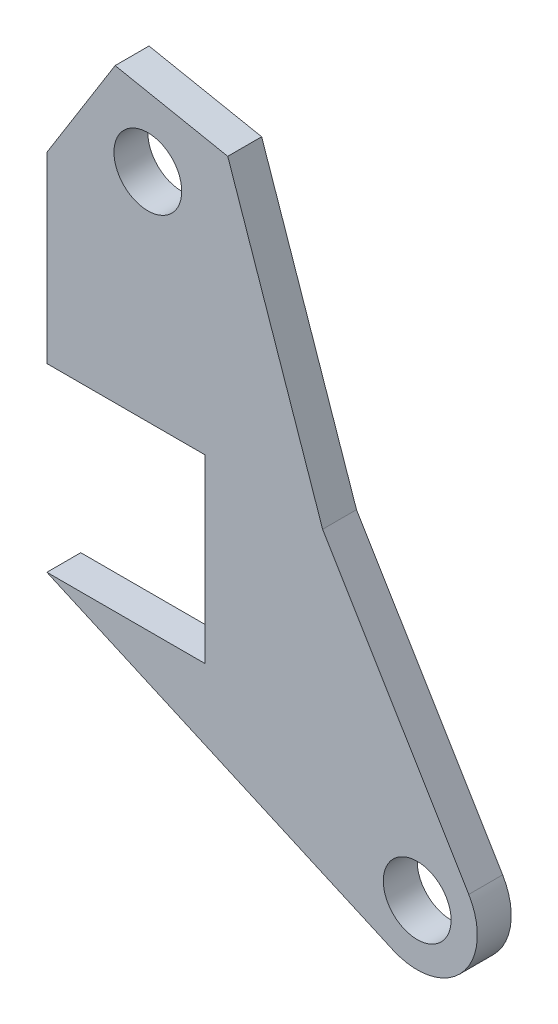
ISO-10303-21;
HEADER;
FILE_DESCRIPTION(('STEP AP214'),'2;1');
FILE_NAME('part.step','',(''),(''),'','','');
FILE_SCHEMA(('AUTOMOTIVE_DESIGN { 1 0 10303 214 1 1 1 1 }'));
ENDSEC;
DATA;
#1=APPLICATION_CONTEXT('core data for automotive mechanical design processes');
#2=APPLICATION_PROTOCOL_DEFINITION('international standard','automotive_design',2000,#1);
#3=PRODUCT_CONTEXT('',#1,'mechanical');
#4=PRODUCT('Part','Part','',(#3));
#5=PRODUCT_RELATED_PRODUCT_CATEGORY('part','',(#4));
#6=PRODUCT_DEFINITION_FORMATION('','',#4);
#7=PRODUCT_DEFINITION_CONTEXT('part definition',#1,'design');
#8=PRODUCT_DEFINITION('design','',#6,#7);
#9=PRODUCT_DEFINITION_SHAPE('','',#8);
#10=(LENGTH_UNIT() NAMED_UNIT(*) SI_UNIT(.MILLI.,.METRE.));
#11=(NAMED_UNIT(*) PLANE_ANGLE_UNIT() SI_UNIT($,.RADIAN.));
#12=(NAMED_UNIT(*) SI_UNIT($,.STERADIAN.) SOLID_ANGLE_UNIT());
#13=UNCERTAINTY_MEASURE_WITH_UNIT(LENGTH_MEASURE(1.E-05),#10,'distance_accuracy_value','');
#14=(GEOMETRIC_REPRESENTATION_CONTEXT(3) GLOBAL_UNCERTAINTY_ASSIGNED_CONTEXT((#13)) GLOBAL_UNIT_ASSIGNED_CONTEXT((#10,
#11,#12)) REPRESENTATION_CONTEXT('',''));
#15=CARTESIAN_POINT('',(0.,0.,0.));
#16=DIRECTION('',(0.,0.,1.));
#17=DIRECTION('',(1.,0.,0.));
#18=AXIS2_PLACEMENT_3D('',#15,#16,#17);
#19=CARTESIAN_POINT('',(163.914369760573,-123.84115803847,15.));
#20=DIRECTION('',(0.,0.,1.));
#21=DIRECTION('',(1.,0.,0.));
#22=AXIS2_PLACEMENT_3D('',#19,#20,#21);
#23=PLANE('',#22);
#24=CARTESIAN_POINT('',(44.6824565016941,95.8944805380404,15.));
#25=DIRECTION('',(0.,0.,1.));
#26=DIRECTION('',(1.,0.,0.));
#27=AXIS2_PLACEMENT_3D('',#24,#25,#26);
#28=CIRCLE('',#27,14.9999999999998);
#29=CARTESIAN_POINT('',(59.6824565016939,95.8944805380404,15.));
#30=VERTEX_POINT('',#29);
#31=EDGE_CURVE('E129',#30,#30,#28,.T.);
#32=ORIENTED_EDGE('',*,*,#31,.F.);
#33=EDGE_LOOP('',(#32));
#34=FACE_BOUND('',#33,.T.);
#35=DIRECTION('',(1.,0.,0.));
#36=VECTOR('',#35,1.);
#37=CARTESIAN_POINT('',(0.,0.,15.));
#38=LINE('',#37,#36);
#39=CARTESIAN_POINT('',(0.,0.,15.));
#40=VERTEX_POINT('',#39);
#41=CARTESIAN_POINT('',(69.9999999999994,0.,15.));
#42=VERTEX_POINT('',#41);
#43=EDGE_CURVE('E151',#40,#42,#38,.T.);
#44=ORIENTED_EDGE('',*,*,#43,.T.);
#45=DIRECTION('',(0.,-1.,0.));
#46=VECTOR('',#45,1.);
#47=CARTESIAN_POINT('',(69.9999999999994,0.,15.));
#48=LINE('',#47,#46);
#49=CARTESIAN_POINT('',(69.9999999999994,-80.0000000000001,15.));
#50=VERTEX_POINT('',#49);
#51=EDGE_CURVE('E124',#42,#50,#48,.T.);
#52=ORIENTED_EDGE('',*,*,#51,.T.);
#53=DIRECTION('',(-1.,0.,0.));
#54=VECTOR('',#53,1.);
#55=CARTESIAN_POINT('',(69.9999999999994,-80.0000000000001,15.));
#56=LINE('',#55,#54);
#57=CARTESIAN_POINT('',(0.,-80.0000000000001,15.));
#58=VERTEX_POINT('',#57);
#59=EDGE_CURVE('E154',#50,#58,#56,.T.);
#60=ORIENTED_EDGE('',*,*,#59,.T.);
#61=DIRECTION('',(0.913545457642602,-0.406736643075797,0.));
#62=VECTOR('',#61,1.);
#63=CARTESIAN_POINT('',(0.,-80.0000000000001,15.));
#64=LINE('',#63,#62);
#65=CARTESIAN_POINT('',(153.087410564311,-148.158906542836,15.));
#66=VERTEX_POINT('',#65);
#67=EDGE_CURVE('E156',#58,#66,#64,.T.);
#68=ORIENTED_EDGE('',*,*,#67,.T.);
#69=CARTESIAN_POINT('',(163.914369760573,-123.84115803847,15.));
#70=DIRECTION('',(0.,0.,1.));
#71=DIRECTION('',(1.,0.,0.));
#72=AXIS2_PLACEMENT_3D('',#69,#70,#71);
#73=CIRCLE('',#72,26.6190897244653);
#74=CARTESIAN_POINT('',(186.73138304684,-110.131313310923,15.));
#75=VERTEX_POINT('',#74);
#76=EDGE_CURVE('E158',#66,#75,#73,.T.);
#77=ORIENTED_EDGE('',*,*,#76,.T.);
#78=DIRECTION('',(-0.515038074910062,0.857167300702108,0.));
#79=VECTOR('',#78,1.);
#80=CARTESIAN_POINT('',(186.73138304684,-110.131313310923,15.));
#81=LINE('',#80,#79);
#82=CARTESIAN_POINT('',(122.055459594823,-2.49250090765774,15.));
#83=VERTEX_POINT('',#82);
#84=EDGE_CURVE('E160',#75,#83,#81,.T.);
#85=ORIENTED_EDGE('',*,*,#84,.T.);
#86=DIRECTION('',(-0.325568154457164,0.945518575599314,0.));
#87=VECTOR('',#86,1.);
#88=CARTESIAN_POINT('',(122.055459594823,-2.49250090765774,15.));
#89=LINE('',#88,#87);
#90=CARTESIAN_POINT('',(80.0571676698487,119.479395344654,15.));
#91=VERTEX_POINT('',#90);
#92=EDGE_CURVE('E162',#83,#91,#89,.T.);
#93=ORIENTED_EDGE('',*,*,#92,.T.);
#94=DIRECTION('',(-0.980998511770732,0.194015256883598,0.));
#95=VECTOR('',#94,1.);
#96=CARTESIAN_POINT('',(30.2053980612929,129.338741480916,15.));
#97=LINE('',#96,#95);
#98=CARTESIAN_POINT('',(30.2053980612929,129.338741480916,15.));
#99=VERTEX_POINT('',#98);
#100=EDGE_CURVE('E164',#91,#99,#97,.T.);
#101=ORIENTED_EDGE('',*,*,#100,.T.);
#102=DIRECTION('',(-0.529919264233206,-0.848048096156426,0.));
#103=VECTOR('',#102,1.);
#104=CARTESIAN_POINT('',(-8.88178419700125E-13,81.,15.));
#105=LINE('',#104,#103);
#106=CARTESIAN_POINT('',(-8.88178419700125E-13,81.,15.));
#107=VERTEX_POINT('',#106);
#108=EDGE_CURVE('E53',#99,#107,#105,.T.);
#109=ORIENTED_EDGE('',*,*,#108,.T.);
#110=DIRECTION('',(0.,-1.,0.));
#111=VECTOR('',#110,1.);
#112=CARTESIAN_POINT('',(0.,0.,15.));
#113=LINE('',#112,#111);
#114=EDGE_CURVE('E48',#107,#40,#113,.T.);
#115=ORIENTED_EDGE('',*,*,#114,.T.);
#116=EDGE_LOOP('',(#44,#52,#60,#68,#77,#85,#93,#101,#109,#115));
#117=FACE_BOUND('',#116,.T.);
#118=CARTESIAN_POINT('',(163.914369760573,-123.84115803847,15.));
#119=DIRECTION('',(0.,0.,1.));
#120=DIRECTION('',(1.,0.,0.));
#121=AXIS2_PLACEMENT_3D('',#118,#119,#120);
#122=CIRCLE('',#121,15.);
#123=CARTESIAN_POINT('',(178.914369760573,-123.84115803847,15.));
#124=VERTEX_POINT('',#123);
#125=EDGE_CURVE('E251',#124,#124,#122,.T.);
#126=ORIENTED_EDGE('',*,*,#125,.F.);
#127=EDGE_LOOP('',(#126));
#128=FACE_BOUND('',#127,.T.);
#129=ADVANCED_FACE('F33',(#34,#117,#128),#23,.T.);
#130=CARTESIAN_POINT('',(163.914369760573,-123.84115803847,0.));
#131=DIRECTION('',(0.,0.,1.));
#132=DIRECTION('',(1.,0.,0.));
#133=AXIS2_PLACEMENT_3D('',#130,#131,#132);
#134=PLANE('',#133);
#135=CARTESIAN_POINT('',(44.6824565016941,95.8944805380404,0.));
#136=DIRECTION('',(0.,0.,1.));
#137=DIRECTION('',(1.,0.,0.));
#138=AXIS2_PLACEMENT_3D('',#135,#136,#137);
#139=CIRCLE('',#138,14.9999999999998);
#140=CARTESIAN_POINT('',(59.6824565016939,95.8944805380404,0.));
#141=VERTEX_POINT('',#140);
#142=EDGE_CURVE('E132',#141,#141,#139,.T.);
#143=ORIENTED_EDGE('',*,*,#142,.T.);
#144=EDGE_LOOP('',(#143));
#145=FACE_BOUND('',#144,.T.);
#146=DIRECTION('',(1.,0.,0.));
#147=VECTOR('',#146,1.);
#148=CARTESIAN_POINT('',(0.,0.,0.));
#149=LINE('',#148,#147);
#150=CARTESIAN_POINT('',(0.,0.,0.));
#151=VERTEX_POINT('',#150);
#152=CARTESIAN_POINT('',(69.9999999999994,0.,0.));
#153=VERTEX_POINT('',#152);
#154=EDGE_CURVE('E115',#151,#153,#149,.T.);
#155=ORIENTED_EDGE('',*,*,#154,.F.);
#156=DIRECTION('',(0.,-1.,0.));
#157=VECTOR('',#156,1.);
#158=CARTESIAN_POINT('',(0.,0.,0.));
#159=LINE('',#158,#157);
#160=CARTESIAN_POINT('',(-8.88178419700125E-13,81.,0.));
#161=VERTEX_POINT('',#160);
#162=EDGE_CURVE('E149',#161,#151,#159,.T.);
#163=ORIENTED_EDGE('',*,*,#162,.F.);
#164=DIRECTION('',(-0.529919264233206,-0.848048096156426,0.));
#165=VECTOR('',#164,1.);
#166=CARTESIAN_POINT('',(-8.88178419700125E-13,81.,0.));
#167=LINE('',#166,#165);
#168=CARTESIAN_POINT('',(30.2053980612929,129.338741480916,0.));
#169=VERTEX_POINT('',#168);
#170=EDGE_CURVE('E147',#169,#161,#167,.T.);
#171=ORIENTED_EDGE('',*,*,#170,.F.);
#172=DIRECTION('',(-0.980998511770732,0.194015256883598,0.));
#173=VECTOR('',#172,1.);
#174=CARTESIAN_POINT('',(30.2053980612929,129.338741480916,0.));
#175=LINE('',#174,#173);
#176=CARTESIAN_POINT('',(80.0571676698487,119.479395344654,0.));
#177=VERTEX_POINT('',#176);
#178=EDGE_CURVE('E145',#177,#169,#175,.T.);
#179=ORIENTED_EDGE('',*,*,#178,.F.);
#180=DIRECTION('',(-0.325568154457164,0.945518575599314,0.));
#181=VECTOR('',#180,1.);
#182=CARTESIAN_POINT('',(122.055459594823,-2.49250090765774,0.));
#183=LINE('',#182,#181);
#184=CARTESIAN_POINT('',(122.055459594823,-2.49250090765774,0.));
#185=VERTEX_POINT('',#184);
#186=EDGE_CURVE('E143',#185,#177,#183,.T.);
#187=ORIENTED_EDGE('',*,*,#186,.F.);
#188=DIRECTION('',(-0.515038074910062,0.857167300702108,0.));
#189=VECTOR('',#188,1.);
#190=CARTESIAN_POINT('',(186.73138304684,-110.131313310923,0.));
#191=LINE('',#190,#189);
#192=CARTESIAN_POINT('',(186.73138304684,-110.131313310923,0.));
#193=VERTEX_POINT('',#192);
#194=EDGE_CURVE('E141',#193,#185,#191,.T.);
#195=ORIENTED_EDGE('',*,*,#194,.F.);
#196=CARTESIAN_POINT('',(163.914369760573,-123.84115803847,0.));
#197=DIRECTION('',(0.,0.,1.));
#198=DIRECTION('',(1.,0.,0.));
#199=AXIS2_PLACEMENT_3D('',#196,#197,#198);
#200=CIRCLE('',#199,26.6190897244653);
#201=CARTESIAN_POINT('',(153.087410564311,-148.158906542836,0.));
#202=VERTEX_POINT('',#201);
#203=EDGE_CURVE('E139',#202,#193,#200,.T.);
#204=ORIENTED_EDGE('',*,*,#203,.F.);
#205=DIRECTION('',(0.913545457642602,-0.406736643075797,0.));
#206=VECTOR('',#205,1.);
#207=CARTESIAN_POINT('',(0.,-80.0000000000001,0.));
#208=LINE('',#207,#206);
#209=CARTESIAN_POINT('',(0.,-80.0000000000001,0.));
#210=VERTEX_POINT('',#209);
#211=EDGE_CURVE('E137',#210,#202,#208,.T.);
#212=ORIENTED_EDGE('',*,*,#211,.F.);
#213=DIRECTION('',(-1.,0.,0.));
#214=VECTOR('',#213,1.);
#215=CARTESIAN_POINT('',(69.9999999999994,-80.0000000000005,0.));
#216=LINE('',#215,#214);
#217=CARTESIAN_POINT('',(69.9999999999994,-80.0000000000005,0.));
#218=VERTEX_POINT('',#217);
#219=EDGE_CURVE('E117',#218,#210,#216,.T.);
#220=ORIENTED_EDGE('',*,*,#219,.F.);
#221=DIRECTION('',(0.,-1.,0.));
#222=VECTOR('',#221,1.);
#223=CARTESIAN_POINT('',(69.9999999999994,0.,0.));
#224=LINE('',#223,#222);
#225=EDGE_CURVE('E110',#153,#218,#224,.T.);
#226=ORIENTED_EDGE('',*,*,#225,.F.);
#227=EDGE_LOOP('',(#155,#163,#171,#179,#187,#195,#204,#212,#220,#226));
#228=FACE_BOUND('',#227,.T.);
#229=CARTESIAN_POINT('',(163.914369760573,-123.84115803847,0.));
#230=DIRECTION('',(0.,0.,1.));
#231=DIRECTION('',(1.,0.,0.));
#232=AXIS2_PLACEMENT_3D('',#229,#230,#231);
#233=CIRCLE('',#232,15.);
#234=CARTESIAN_POINT('',(178.914369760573,-123.84115803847,0.));
#235=VERTEX_POINT('',#234);
#236=EDGE_CURVE('E254',#235,#235,#233,.T.);
#237=ORIENTED_EDGE('',*,*,#236,.T.);
#238=EDGE_LOOP('',(#237));
#239=FACE_BOUND('',#238,.T.);
#240=ADVANCED_FACE('F111',(#145,#228,#239),#134,.F.);
#241=CARTESIAN_POINT('',(0.,0.,15.));
#242=DIRECTION('',(0.,1.,0.));
#243=DIRECTION('',(0.,0.,1.));
#244=AXIS2_PLACEMENT_3D('',#241,#242,#243);
#245=PLANE('',#244);
#246=ORIENTED_EDGE('',*,*,#154,.T.);
#247=DIRECTION('',(0.,0.,-1.));
#248=VECTOR('',#247,1.);
#249=CARTESIAN_POINT('',(69.9999999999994,0.,15.));
#250=LINE('',#249,#248);
#251=EDGE_CURVE('E11',#42,#153,#250,.T.);
#252=ORIENTED_EDGE('',*,*,#251,.F.);
#253=ORIENTED_EDGE('',*,*,#43,.F.);
#254=DIRECTION('',(0.,0.,-1.));
#255=VECTOR('',#254,1.);
#256=CARTESIAN_POINT('',(0.,0.,15.));
#257=LINE('',#256,#255);
#258=EDGE_CURVE('E128',#40,#151,#257,.T.);
#259=ORIENTED_EDGE('',*,*,#258,.T.);
#260=EDGE_LOOP('',(#246,#252,#253,#259));
#261=FACE_BOUND('',#260,.T.);
#262=ADVANCED_FACE('F35',(#261),#245,.F.);
#263=CARTESIAN_POINT('',(69.9999999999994,0.,15.));
#264=DIRECTION('',(1.,0.,0.));
#265=DIRECTION('',(0.,1.,0.));
#266=AXIS2_PLACEMENT_3D('',#263,#264,#265);
#267=PLANE('',#266);
#268=ORIENTED_EDGE('',*,*,#225,.T.);
#269=DIRECTION('',(0.,0.,-1.));
#270=VECTOR('',#269,1.);
#271=CARTESIAN_POINT('',(69.9999999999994,-80.0000000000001,15.));
#272=LINE('',#271,#270);
#273=EDGE_CURVE('E41',#50,#218,#272,.T.);
#274=ORIENTED_EDGE('',*,*,#273,.F.);
#275=ORIENTED_EDGE('',*,*,#51,.F.);
#276=ORIENTED_EDGE('',*,*,#251,.T.);
#277=EDGE_LOOP('',(#268,#274,#275,#276));
#278=FACE_BOUND('',#277,.T.);
#279=ADVANCED_FACE('F123',(#278),#267,.F.);
#280=CARTESIAN_POINT('',(69.9999999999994,-80.0000000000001,15.));
#281=DIRECTION('',(0.,-1.,0.));
#282=DIRECTION('',(1.,0.,0.));
#283=AXIS2_PLACEMENT_3D('',#280,#281,#282);
#284=PLANE('',#283);
#285=ORIENTED_EDGE('',*,*,#219,.T.);
#286=DIRECTION('',(0.,0.,-1.));
#287=VECTOR('',#286,1.);
#288=CARTESIAN_POINT('',(0.,-80.0000000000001,15.));
#289=LINE('',#288,#287);
#290=EDGE_CURVE('E187',#58,#210,#289,.T.);
#291=ORIENTED_EDGE('',*,*,#290,.F.);
#292=ORIENTED_EDGE('',*,*,#59,.F.);
#293=ORIENTED_EDGE('',*,*,#273,.T.);
#294=EDGE_LOOP('',(#285,#291,#292,#293));
#295=FACE_BOUND('',#294,.T.);
#296=ADVANCED_FACE('F191',(#295),#284,.F.);
#297=CARTESIAN_POINT('',(0.,-80.0000000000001,15.));
#298=DIRECTION('',(0.406736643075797,0.913545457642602,0.));
#299=DIRECTION('',(-0.913545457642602,0.406736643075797,0.));
#300=AXIS2_PLACEMENT_3D('',#297,#298,#299);
#301=PLANE('',#300);
#302=ORIENTED_EDGE('',*,*,#211,.T.);
#303=DIRECTION('',(0.,0.,-1.));
#304=VECTOR('',#303,1.);
#305=CARTESIAN_POINT('',(153.087410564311,-148.158906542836,15.));
#306=LINE('',#305,#304);
#307=EDGE_CURVE('E184',#66,#202,#306,.T.);
#308=ORIENTED_EDGE('',*,*,#307,.F.);
#309=ORIENTED_EDGE('',*,*,#67,.F.);
#310=ORIENTED_EDGE('',*,*,#290,.T.);
#311=EDGE_LOOP('',(#302,#308,#309,#310));
#312=FACE_BOUND('',#311,.T.);
#313=ADVANCED_FACE('F199',(#312),#301,.F.);
#314=CARTESIAN_POINT('',(163.914369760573,-123.84115803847,15.));
#315=DIRECTION('',(0.,0.,-1.));
#316=DIRECTION('',(-1.,0.,0.));
#317=AXIS2_PLACEMENT_3D('',#314,#315,#316);
#318=CYLINDRICAL_SURFACE('',#317,26.6190897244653);
#319=ORIENTED_EDGE('',*,*,#203,.T.);
#320=DIRECTION('',(0.,0.,-1.));
#321=VECTOR('',#320,1.);
#322=CARTESIAN_POINT('',(186.73138304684,-110.131313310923,15.));
#323=LINE('',#322,#321);
#324=EDGE_CURVE('E181',#75,#193,#323,.T.);
#325=ORIENTED_EDGE('',*,*,#324,.F.);
#326=ORIENTED_EDGE('',*,*,#76,.F.);
#327=ORIENTED_EDGE('',*,*,#307,.T.);
#328=EDGE_LOOP('',(#319,#325,#326,#327));
#329=FACE_BOUND('',#328,.T.);
#330=ADVANCED_FACE('F202',(#329),#318,.T.);
#331=CARTESIAN_POINT('',(186.73138304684,-110.131313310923,15.));
#332=DIRECTION('',(-0.857167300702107,-0.515038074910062,0.));
#333=DIRECTION('',(0.515038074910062,-0.857167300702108,0.));
#334=AXIS2_PLACEMENT_3D('',#331,#332,#333);
#335=PLANE('',#334);
#336=ORIENTED_EDGE('',*,*,#194,.T.);
#337=DIRECTION('',(0.,0.,-1.));
#338=VECTOR('',#337,1.);
#339=CARTESIAN_POINT('',(122.055459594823,-2.49250090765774,15.));
#340=LINE('',#339,#338);
#341=EDGE_CURVE('E178',#83,#185,#340,.T.);
#342=ORIENTED_EDGE('',*,*,#341,.F.);
#343=ORIENTED_EDGE('',*,*,#84,.F.);
#344=ORIENTED_EDGE('',*,*,#324,.T.);
#345=EDGE_LOOP('',(#336,#342,#343,#344));
#346=FACE_BOUND('',#345,.T.);
#347=ADVANCED_FACE('F207',(#346),#335,.F.);
#348=CARTESIAN_POINT('',(122.055459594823,-2.49250090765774,15.));
#349=DIRECTION('',(-0.945518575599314,-0.325568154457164,0.));
#350=DIRECTION('',(0.325568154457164,-0.945518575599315,0.));
#351=AXIS2_PLACEMENT_3D('',#348,#349,#350);
#352=PLANE('',#351);
#353=ORIENTED_EDGE('',*,*,#186,.T.);
#354=DIRECTION('',(0.,0.,-1.));
#355=VECTOR('',#354,1.);
#356=CARTESIAN_POINT('',(80.0571676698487,119.479395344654,15.));
#357=LINE('',#356,#355);
#358=EDGE_CURVE('E175',#91,#177,#357,.T.);
#359=ORIENTED_EDGE('',*,*,#358,.F.);
#360=ORIENTED_EDGE('',*,*,#92,.F.);
#361=ORIENTED_EDGE('',*,*,#341,.T.);
#362=EDGE_LOOP('',(#353,#359,#360,#361));
#363=FACE_BOUND('',#362,.T.);
#364=ADVANCED_FACE('F213',(#363),#352,.F.);
#365=CARTESIAN_POINT('',(30.2053980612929,129.338741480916,15.));
#366=DIRECTION('',(-0.194015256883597,-0.980998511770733,0.));
#367=DIRECTION('',(0.980998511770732,-0.194015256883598,0.));
#368=AXIS2_PLACEMENT_3D('',#365,#366,#367);
#369=PLANE('',#368);
#370=ORIENTED_EDGE('',*,*,#178,.T.);
#371=DIRECTION('',(0.,0.,-1.));
#372=VECTOR('',#371,1.);
#373=CARTESIAN_POINT('',(30.2053980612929,129.338741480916,15.));
#374=LINE('',#373,#372);
#375=EDGE_CURVE('E172',#99,#169,#374,.T.);
#376=ORIENTED_EDGE('',*,*,#375,.F.);
#377=ORIENTED_EDGE('',*,*,#100,.F.);
#378=ORIENTED_EDGE('',*,*,#358,.T.);
#379=EDGE_LOOP('',(#370,#376,#377,#378));
#380=FACE_BOUND('',#379,.T.);
#381=ADVANCED_FACE('F217',(#380),#369,.F.);
#382=CARTESIAN_POINT('',(-8.88178419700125E-13,81.,15.));
#383=DIRECTION('',(0.848048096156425,-0.529919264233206,0.));
#384=DIRECTION('',(0.529919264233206,0.848048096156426,0.));
#385=AXIS2_PLACEMENT_3D('',#382,#383,#384);
#386=PLANE('',#385);
#387=ORIENTED_EDGE('',*,*,#170,.T.);
#388=DIRECTION('',(0.,0.,-1.));
#389=VECTOR('',#388,1.);
#390=CARTESIAN_POINT('',(-8.88178419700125E-13,81.,15.));
#391=LINE('',#390,#389);
#392=EDGE_CURVE('E169',#107,#161,#391,.T.);
#393=ORIENTED_EDGE('',*,*,#392,.F.);
#394=ORIENTED_EDGE('',*,*,#108,.F.);
#395=ORIENTED_EDGE('',*,*,#375,.T.);
#396=EDGE_LOOP('',(#387,#393,#394,#395));
#397=FACE_BOUND('',#396,.T.);
#398=ADVANCED_FACE('F220',(#397),#386,.F.);
#399=CARTESIAN_POINT('',(0.,0.,15.));
#400=DIRECTION('',(1.,0.,0.));
#401=DIRECTION('',(0.,0.,-1.));
#402=AXIS2_PLACEMENT_3D('',#399,#400,#401);
#403=PLANE('',#402);
#404=ORIENTED_EDGE('',*,*,#162,.T.);
#405=ORIENTED_EDGE('',*,*,#258,.F.);
#406=ORIENTED_EDGE('',*,*,#114,.F.);
#407=ORIENTED_EDGE('',*,*,#392,.T.);
#408=EDGE_LOOP('',(#404,#405,#406,#407));
#409=FACE_BOUND('',#408,.T.);
#410=ADVANCED_FACE('F222',(#409),#403,.F.);
#411=CARTESIAN_POINT('',(44.6824565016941,95.8944805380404,15.));
#412=DIRECTION('',(0.,0.,-1.));
#413=DIRECTION('',(-1.,0.,0.));
#414=AXIS2_PLACEMENT_3D('',#411,#412,#413);
#415=CYLINDRICAL_SURFACE('',#414,14.9999999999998);
#416=ORIENTED_EDGE('',*,*,#31,.T.);
#417=EDGE_LOOP('',(#416));
#418=FACE_BOUND('',#417,.T.);
#419=ORIENTED_EDGE('',*,*,#142,.F.);
#420=EDGE_LOOP('',(#419));
#421=FACE_BOUND('',#420,.T.);
#422=ADVANCED_FACE('F224',(#418,#421),#415,.F.);
#423=CARTESIAN_POINT('',(163.914369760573,-123.84115803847,15.));
#424=DIRECTION('',(0.,0.,-1.));
#425=DIRECTION('',(-1.,0.,0.));
#426=AXIS2_PLACEMENT_3D('',#423,#424,#425);
#427=CYLINDRICAL_SURFACE('',#426,15.);
#428=ORIENTED_EDGE('',*,*,#125,.T.);
#429=EDGE_LOOP('',(#428));
#430=FACE_BOUND('',#429,.T.);
#431=ORIENTED_EDGE('',*,*,#236,.F.);
#432=EDGE_LOOP('',(#431));
#433=FACE_BOUND('',#432,.T.);
#434=ADVANCED_FACE('F230',(#430,#433),#427,.F.);
#435=CLOSED_SHELL('',(#129,#240,#262,#279,#296,#313,#330,#347,#364,#381,#398,#410,#422,#434));
#436=MANIFOLD_SOLID_BREP('B2',#435);
#437=ADVANCED_BREP_SHAPE_REPRESENTATION('',(#18,#436),#14);
#438=SHAPE_DEFINITION_REPRESENTATION(#9,#437);
ENDSEC;
END-ISO-10303-21;
